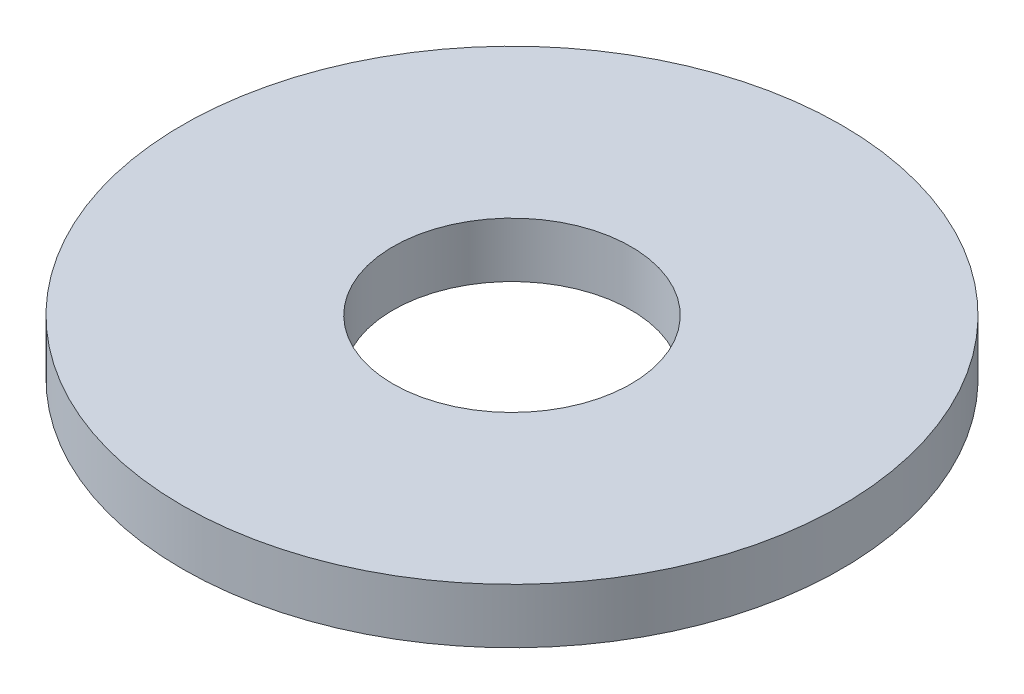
ISO-10303-21;
HEADER;
FILE_DESCRIPTION(('STEP AP214'),'2;1');
FILE_NAME('part.step','',(''),(''),'','','');
FILE_SCHEMA(('AUTOMOTIVE_DESIGN { 1 0 10303 214 1 1 1 1 }'));
ENDSEC;
DATA;
#1=APPLICATION_CONTEXT('core data for automotive mechanical design processes');
#2=APPLICATION_PROTOCOL_DEFINITION('international standard','automotive_design',2000,#1);
#3=PRODUCT_CONTEXT('',#1,'mechanical');
#4=PRODUCT('Part','Part','',(#3));
#5=PRODUCT_RELATED_PRODUCT_CATEGORY('part','',(#4));
#6=PRODUCT_DEFINITION_FORMATION('','',#4);
#7=PRODUCT_DEFINITION_CONTEXT('part definition',#1,'design');
#8=PRODUCT_DEFINITION('design','',#6,#7);
#9=PRODUCT_DEFINITION_SHAPE('','',#8);
#10=(LENGTH_UNIT() NAMED_UNIT(*) SI_UNIT(.MILLI.,.METRE.));
#11=(NAMED_UNIT(*) PLANE_ANGLE_UNIT() SI_UNIT($,.RADIAN.));
#12=(NAMED_UNIT(*) SI_UNIT($,.STERADIAN.) SOLID_ANGLE_UNIT());
#13=UNCERTAINTY_MEASURE_WITH_UNIT(LENGTH_MEASURE(1.E-05),#10,'distance_accuracy_value','');
#14=(GEOMETRIC_REPRESENTATION_CONTEXT(3) GLOBAL_UNCERTAINTY_ASSIGNED_CONTEXT((#13)) GLOBAL_UNIT_ASSIGNED_CONTEXT((#10,
#11,#12)) REPRESENTATION_CONTEXT('',''));
#15=CARTESIAN_POINT('',(0.,0.,0.));
#16=DIRECTION('',(0.,0.,1.));
#17=DIRECTION('',(1.,0.,0.));
#18=AXIS2_PLACEMENT_3D('',#15,#16,#17);
#19=CARTESIAN_POINT('',(0.,3.,0.));
#20=DIRECTION('',(0.,1.,0.));
#21=DIRECTION('',(0.,0.,1.));
#22=AXIS2_PLACEMENT_3D('',#19,#20,#21);
#23=PLANE('',#22);
#24=CARTESIAN_POINT('',(0.,3.,0.));
#25=DIRECTION('',(0.,1.,0.));
#26=DIRECTION('',(0.,0.,1.));
#27=AXIS2_PLACEMENT_3D('',#24,#25,#26);
#28=CIRCLE('',#27,18.);
#29=CARTESIAN_POINT('',(0.,3.,18.));
#30=VERTEX_POINT('',#29);
#31=EDGE_CURVE('E10',#30,#30,#28,.T.);
#32=ORIENTED_EDGE('',*,*,#31,.T.);
#33=EDGE_LOOP('',(#32));
#34=FACE_BOUND('',#33,.T.);
#35=CARTESIAN_POINT('',(0.,3.,0.));
#36=DIRECTION('',(0.,1.,0.));
#37=DIRECTION('',(0.,0.,1.));
#38=AXIS2_PLACEMENT_3D('',#35,#36,#37);
#39=CIRCLE('',#38,6.5);
#40=CARTESIAN_POINT('',(0.,3.,6.5));
#41=VERTEX_POINT('',#40);
#42=EDGE_CURVE('E42',#41,#41,#39,.T.);
#43=ORIENTED_EDGE('',*,*,#42,.F.);
#44=EDGE_LOOP('',(#43));
#45=FACE_BOUND('',#44,.T.);
#46=ADVANCED_FACE('F31',(#34,#45),#23,.T.);
#47=CARTESIAN_POINT('',(0.,0.,0.));
#48=DIRECTION('',(0.,1.,0.));
#49=DIRECTION('',(0.,0.,1.));
#50=AXIS2_PLACEMENT_3D('',#47,#48,#49);
#51=PLANE('',#50);
#52=CARTESIAN_POINT('',(0.,0.,0.));
#53=DIRECTION('',(0.,1.,0.));
#54=DIRECTION('',(0.,0.,1.));
#55=AXIS2_PLACEMENT_3D('',#52,#53,#54);
#56=CIRCLE('',#55,18.);
#57=CARTESIAN_POINT('',(0.,0.,18.));
#58=VERTEX_POINT('',#57);
#59=EDGE_CURVE('E35',#58,#58,#56,.T.);
#60=ORIENTED_EDGE('',*,*,#59,.F.);
#61=EDGE_LOOP('',(#60));
#62=FACE_BOUND('',#61,.T.);
#63=CARTESIAN_POINT('',(0.,0.,0.));
#64=DIRECTION('',(0.,1.,0.));
#65=DIRECTION('',(0.,0.,1.));
#66=AXIS2_PLACEMENT_3D('',#63,#64,#65);
#67=CIRCLE('',#66,6.5);
#68=CARTESIAN_POINT('',(0.,0.,6.5));
#69=VERTEX_POINT('',#68);
#70=EDGE_CURVE('E44',#69,#69,#67,.T.);
#71=ORIENTED_EDGE('',*,*,#70,.T.);
#72=EDGE_LOOP('',(#71));
#73=FACE_BOUND('',#72,.T.);
#74=ADVANCED_FACE('F54',(#62,#73),#51,.F.);
#75=CARTESIAN_POINT('',(0.,3.,0.));
#76=DIRECTION('',(0.,-1.,0.));
#77=DIRECTION('',(0.,0.,-1.));
#78=AXIS2_PLACEMENT_3D('',#75,#76,#77);
#79=CYLINDRICAL_SURFACE('',#78,18.);
#80=ORIENTED_EDGE('',*,*,#31,.F.);
#81=EDGE_LOOP('',(#80));
#82=FACE_BOUND('',#81,.T.);
#83=ORIENTED_EDGE('',*,*,#59,.T.);
#84=EDGE_LOOP('',(#83));
#85=FACE_BOUND('',#84,.T.);
#86=ADVANCED_FACE('F33',(#82,#85),#79,.T.);
#87=CARTESIAN_POINT('',(0.,3.,0.));
#88=DIRECTION('',(0.,-1.,0.));
#89=DIRECTION('',(0.,0.,-1.));
#90=AXIS2_PLACEMENT_3D('',#87,#88,#89);
#91=CYLINDRICAL_SURFACE('',#90,6.5);
#92=ORIENTED_EDGE('',*,*,#42,.T.);
#93=EDGE_LOOP('',(#92));
#94=FACE_BOUND('',#93,.T.);
#95=ORIENTED_EDGE('',*,*,#70,.F.);
#96=EDGE_LOOP('',(#95));
#97=FACE_BOUND('',#96,.T.);
#98=ADVANCED_FACE('F50',(#94,#97),#91,.F.);
#99=CLOSED_SHELL('',(#46,#74,#86,#98));
#100=MANIFOLD_SOLID_BREP('B2',#99);
#101=ADVANCED_BREP_SHAPE_REPRESENTATION('',(#18,#100),#14);
#102=SHAPE_DEFINITION_REPRESENTATION(#9,#101);
ENDSEC;
END-ISO-10303-21;
